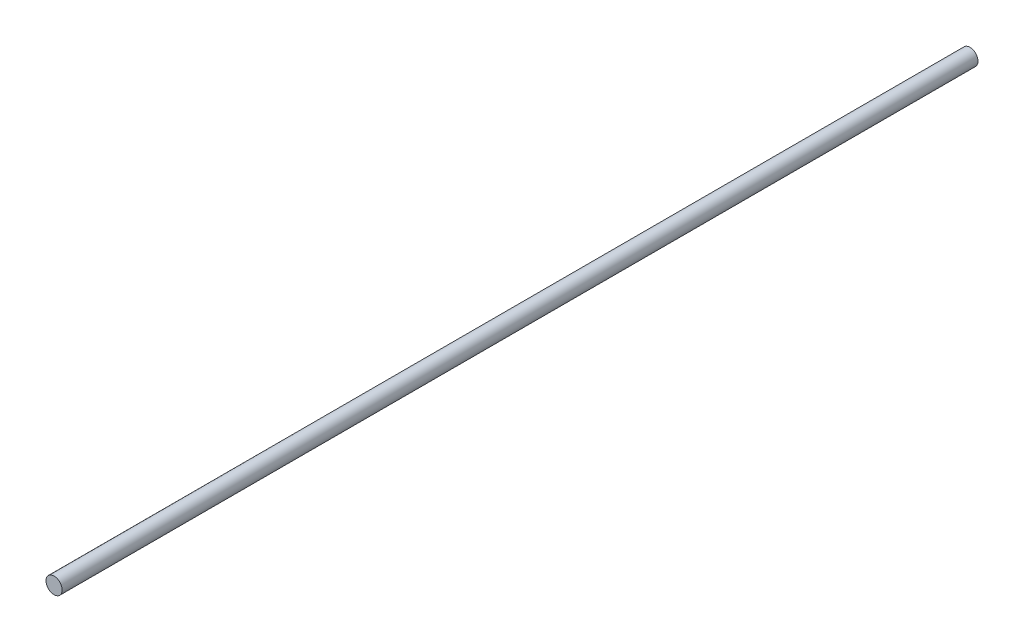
ISO-10303-21;
HEADER;
FILE_DESCRIPTION(('STEP AP214'),'2;1');
FILE_NAME('part.step','',(''),(''),'','','');
FILE_SCHEMA(('AUTOMOTIVE_DESIGN { 1 0 10303 214 1 1 1 1 }'));
ENDSEC;
DATA;
#1=APPLICATION_CONTEXT('core data for automotive mechanical design processes');
#2=APPLICATION_PROTOCOL_DEFINITION('international standard','automotive_design',2000,#1);
#3=PRODUCT_CONTEXT('',#1,'mechanical');
#4=PRODUCT('Part','Part','',(#3));
#5=PRODUCT_RELATED_PRODUCT_CATEGORY('part','',(#4));
#6=PRODUCT_DEFINITION_FORMATION('','',#4);
#7=PRODUCT_DEFINITION_CONTEXT('part definition',#1,'design');
#8=PRODUCT_DEFINITION('design','',#6,#7);
#9=PRODUCT_DEFINITION_SHAPE('','',#8);
#10=(LENGTH_UNIT() NAMED_UNIT(*) SI_UNIT(.MILLI.,.METRE.));
#11=(NAMED_UNIT(*) PLANE_ANGLE_UNIT() SI_UNIT($,.RADIAN.));
#12=(NAMED_UNIT(*) SI_UNIT($,.STERADIAN.) SOLID_ANGLE_UNIT());
#13=UNCERTAINTY_MEASURE_WITH_UNIT(LENGTH_MEASURE(1.E-05),#10,'distance_accuracy_value','');
#14=(GEOMETRIC_REPRESENTATION_CONTEXT(3) GLOBAL_UNCERTAINTY_ASSIGNED_CONTEXT((#13)) GLOBAL_UNIT_ASSIGNED_CONTEXT((#10,
#11,#12)) REPRESENTATION_CONTEXT('',''));
#15=CARTESIAN_POINT('',(0.,0.,0.));
#16=DIRECTION('',(0.,0.,1.));
#17=DIRECTION('',(1.,0.,0.));
#18=AXIS2_PLACEMENT_3D('',#15,#16,#17);
#19=CARTESIAN_POINT('',(0.,0.,340.));
#20=DIRECTION('',(0.,0.,-1.));
#21=DIRECTION('',(-1.,0.,0.));
#22=AXIS2_PLACEMENT_3D('',#19,#20,#21);
#23=CYLINDRICAL_SURFACE('',#22,3.);
#24=CARTESIAN_POINT('',(0.,0.,340.));
#25=DIRECTION('',(0.,0.,1.));
#26=DIRECTION('',(1.,0.,0.));
#27=AXIS2_PLACEMENT_3D('',#24,#25,#26);
#28=CIRCLE('',#27,3.);
#29=CARTESIAN_POINT('',(3.,0.,340.));
#30=VERTEX_POINT('',#29);
#31=EDGE_CURVE('E10',#30,#30,#28,.T.);
#32=ORIENTED_EDGE('',*,*,#31,.F.);
#33=EDGE_LOOP('',(#32));
#34=FACE_BOUND('',#33,.T.);
#35=CARTESIAN_POINT('',(0.,0.,0.));
#36=DIRECTION('',(0.,0.,1.));
#37=DIRECTION('',(1.,0.,0.));
#38=AXIS2_PLACEMENT_3D('',#35,#36,#37);
#39=CIRCLE('',#38,3.);
#40=CARTESIAN_POINT('',(3.,0.,0.));
#41=VERTEX_POINT('',#40);
#42=EDGE_CURVE('E44',#41,#41,#39,.T.);
#43=ORIENTED_EDGE('',*,*,#42,.T.);
#44=EDGE_LOOP('',(#43));
#45=FACE_BOUND('',#44,.T.);
#46=ADVANCED_FACE('F41',(#34,#45),#23,.T.);
#47=CARTESIAN_POINT('',(0.,0.,340.));
#48=DIRECTION('',(0.,0.,1.));
#49=DIRECTION('',(1.,0.,0.));
#50=AXIS2_PLACEMENT_3D('',#47,#48,#49);
#51=PLANE('',#50);
#52=ORIENTED_EDGE('',*,*,#31,.T.);
#53=EDGE_LOOP('',(#52));
#54=FACE_BOUND('',#53,.T.);
#55=ADVANCED_FACE('F60',(#54),#51,.T.);
#56=CARTESIAN_POINT('',(0.,0.,0.));
#57=DIRECTION('',(0.,0.,1.));
#58=DIRECTION('',(1.,0.,0.));
#59=AXIS2_PLACEMENT_3D('',#56,#57,#58);
#60=PLANE('',#59);
#61=ORIENTED_EDGE('',*,*,#42,.F.);
#62=EDGE_LOOP('',(#61));
#63=FACE_BOUND('',#62,.T.);
#64=ADVANCED_FACE('F58',(#63),#60,.F.);
#65=CLOSED_SHELL('',(#46,#55,#64));
#66=MANIFOLD_SOLID_BREP('B2',#65);
#67=ADVANCED_BREP_SHAPE_REPRESENTATION('',(#18,#66),#14);
#68=SHAPE_DEFINITION_REPRESENTATION(#9,#67);
ENDSEC;
END-ISO-10303-21;
